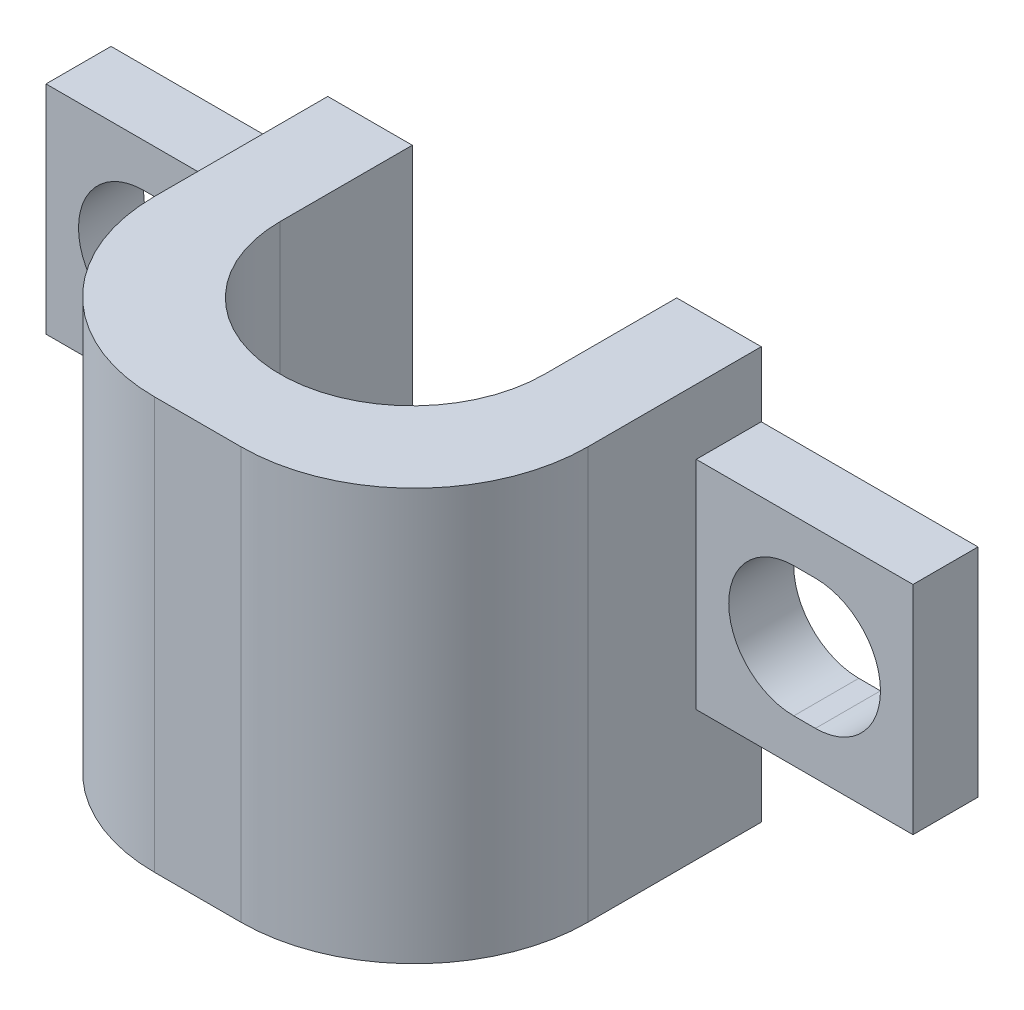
ISO-10303-21;
HEADER;
FILE_DESCRIPTION(('STEP AP214'),'2;1');
FILE_NAME('part.step','',(''),(''),'','','');
FILE_SCHEMA(('AUTOMOTIVE_DESIGN { 1 0 10303 214 1 1 1 1 }'));
ENDSEC;
DATA;
#1=APPLICATION_CONTEXT('core data for automotive mechanical design processes');
#2=APPLICATION_PROTOCOL_DEFINITION('international standard','automotive_design',2000,#1);
#3=PRODUCT_CONTEXT('',#1,'mechanical');
#4=PRODUCT('Part','Part','',(#3));
#5=PRODUCT_RELATED_PRODUCT_CATEGORY('part','',(#4));
#6=PRODUCT_DEFINITION_FORMATION('','',#4);
#7=PRODUCT_DEFINITION_CONTEXT('part definition',#1,'design');
#8=PRODUCT_DEFINITION('design','',#6,#7);
#9=PRODUCT_DEFINITION_SHAPE('','',#8);
#10=(LENGTH_UNIT() NAMED_UNIT(*) SI_UNIT(.MILLI.,.METRE.));
#11=(NAMED_UNIT(*) PLANE_ANGLE_UNIT() SI_UNIT($,.RADIAN.));
#12=(NAMED_UNIT(*) SI_UNIT($,.STERADIAN.) SOLID_ANGLE_UNIT());
#13=UNCERTAINTY_MEASURE_WITH_UNIT(LENGTH_MEASURE(1.E-05),#10,'distance_accuracy_value','');
#14=(GEOMETRIC_REPRESENTATION_CONTEXT(3) GLOBAL_UNCERTAINTY_ASSIGNED_CONTEXT((#13)) GLOBAL_UNIT_ASSIGNED_CONTEXT((#10,
#11,#12)) REPRESENTATION_CONTEXT('',''));
#15=CARTESIAN_POINT('',(0.,0.,0.));
#16=DIRECTION('',(0.,0.,1.));
#17=DIRECTION('',(1.,0.,0.));
#18=AXIS2_PLACEMENT_3D('',#15,#16,#17);
#19=CARTESIAN_POINT('',(-5.,8.,-3.05));
#20=DIRECTION('',(1.,0.,0.));
#21=DIRECTION('',(0.,0.,-1.));
#22=AXIS2_PLACEMENT_3D('',#19,#20,#21);
#23=PLANE('',#22);
#24=DIRECTION('',(0.,0.,-1.));
#25=VECTOR('',#24,1.);
#26=CARTESIAN_POINT('',(-5.,1.5,-1.55));
#27=LINE('',#26,#25);
#28=CARTESIAN_POINT('',(-5.,1.5,-1.55));
#29=VERTEX_POINT('',#28);
#30=CARTESIAN_POINT('',(-5.,1.5,-3.05));
#31=VERTEX_POINT('',#30);
#32=EDGE_CURVE('E388',#29,#31,#27,.T.);
#33=ORIENTED_EDGE('',*,*,#32,.T.);
#34=DIRECTION('',(0.,-1.,0.));
#35=VECTOR('',#34,1.);
#36=CARTESIAN_POINT('',(-5.,8.,-3.05));
#37=LINE('',#36,#35);
#38=CARTESIAN_POINT('',(-5.,-1.5,-3.05));
#39=VERTEX_POINT('',#38);
#40=EDGE_CURVE('E246',#31,#39,#37,.T.);
#41=ORIENTED_EDGE('',*,*,#40,.T.);
#42=DIRECTION('',(0.,0.,-1.));
#43=VECTOR('',#42,1.);
#44=CARTESIAN_POINT('',(-5.,-1.5,0.95));
#45=LINE('',#44,#43);
#46=CARTESIAN_POINT('',(-5.,-1.5,0.95));
#47=VERTEX_POINT('',#46);
#48=EDGE_CURVE('E245',#47,#39,#45,.T.);
#49=ORIENTED_EDGE('',*,*,#48,.F.);
#50=DIRECTION('',(0.,-1.,0.));
#51=VECTOR('',#50,1.);
#52=CARTESIAN_POINT('',(-5.,8.,0.95));
#53=LINE('',#52,#51);
#54=CARTESIAN_POINT('',(-5.,8.,0.95));
#55=VERTEX_POINT('',#54);
#56=EDGE_CURVE('E11',#55,#47,#53,.T.);
#57=ORIENTED_EDGE('',*,*,#56,.F.);
#58=DIRECTION('',(0.,0.,1.));
#59=VECTOR('',#58,1.);
#60=CARTESIAN_POINT('',(-5.,8.,-3.05));
#61=LINE('',#60,#59);
#62=CARTESIAN_POINT('',(-5.,8.,-3.05));
#63=VERTEX_POINT('',#62);
#64=EDGE_CURVE('E481',#63,#55,#61,.T.);
#65=ORIENTED_EDGE('',*,*,#64,.F.);
#66=CARTESIAN_POINT('',(-5.,6.5,-3.05));
#67=VERTEX_POINT('',#66);
#68=EDGE_CURVE('E521',#63,#67,#37,.T.);
#69=ORIENTED_EDGE('',*,*,#68,.T.);
#70=DIRECTION('',(0.,0.,-1.));
#71=VECTOR('',#70,1.);
#72=CARTESIAN_POINT('',(-5.,6.5,-1.55));
#73=LINE('',#72,#71);
#74=CARTESIAN_POINT('',(-5.,6.5,-1.55));
#75=VERTEX_POINT('',#74);
#76=EDGE_CURVE('E61',#75,#67,#73,.T.);
#77=ORIENTED_EDGE('',*,*,#76,.F.);
#78=DIRECTION('',(0.,1.,0.));
#79=VECTOR('',#78,1.);
#80=CARTESIAN_POINT('',(-5.,6.5,-1.55));
#81=LINE('',#80,#79);
#82=EDGE_CURVE('E56',#29,#75,#81,.T.);
#83=ORIENTED_EDGE('',*,*,#82,.F.);
#84=EDGE_LOOP('',(#33,#41,#49,#57,#65,#69,#77,#83));
#85=FACE_BOUND('',#84,.T.);
#86=ADVANCED_FACE('F41',(#85),#23,.F.);
#87=CARTESIAN_POINT('',(-1.,8.,0.950000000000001));
#88=DIRECTION('',(0.,-1.,0.));
#89=DIRECTION('',(0.,0.,-1.));
#90=AXIS2_PLACEMENT_3D('',#87,#88,#89);
#91=CYLINDRICAL_SURFACE('',#90,4.);
#92=ORIENTED_EDGE('',*,*,#56,.T.);
#93=CARTESIAN_POINT('',(-1.,-1.5,0.950000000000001));
#94=DIRECTION('',(0.,-1.,0.));
#95=DIRECTION('',(0.,0.,-1.));
#96=AXIS2_PLACEMENT_3D('',#93,#94,#95);
#97=CIRCLE('',#96,4.);
#98=CARTESIAN_POINT('',(-1.,-1.5,4.95));
#99=VERTEX_POINT('',#98);
#100=EDGE_CURVE('E240',#99,#47,#97,.T.);
#101=ORIENTED_EDGE('',*,*,#100,.F.);
#102=DIRECTION('',(0.,-1.,0.));
#103=VECTOR('',#102,1.);
#104=CARTESIAN_POINT('',(-1.,8.,4.95));
#105=LINE('',#104,#103);
#106=CARTESIAN_POINT('',(-1.,8.,4.95));
#107=VERTEX_POINT('',#106);
#108=EDGE_CURVE('E49',#107,#99,#105,.T.);
#109=ORIENTED_EDGE('',*,*,#108,.F.);
#110=CARTESIAN_POINT('',(-1.,8.,0.950000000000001));
#111=DIRECTION('',(0.,1.,0.));
#112=DIRECTION('',(0.,0.,1.));
#113=AXIS2_PLACEMENT_3D('',#110,#111,#112);
#114=CIRCLE('',#113,4.);
#115=EDGE_CURVE('E241',#55,#107,#114,.T.);
#116=ORIENTED_EDGE('',*,*,#115,.F.);
#117=EDGE_LOOP('',(#92,#101,#109,#116));
#118=FACE_BOUND('',#117,.T.);
#119=ADVANCED_FACE('F237',(#118),#91,.T.);
#120=CARTESIAN_POINT('',(-1.,8.,4.95));
#121=DIRECTION('',(0.,0.,-1.));
#122=DIRECTION('',(-1.,0.,0.));
#123=AXIS2_PLACEMENT_3D('',#120,#121,#122);
#124=PLANE('',#123);
#125=ORIENTED_EDGE('',*,*,#108,.T.);
#126=DIRECTION('',(-1.,0.,0.));
#127=VECTOR('',#126,1.);
#128=CARTESIAN_POINT('',(1.,-1.5,4.95));
#129=LINE('',#128,#127);
#130=CARTESIAN_POINT('',(1.,-1.5,4.95));
#131=VERTEX_POINT('',#130);
#132=EDGE_CURVE('E256',#131,#99,#129,.T.);
#133=ORIENTED_EDGE('',*,*,#132,.F.);
#134=DIRECTION('',(0.,-1.,0.));
#135=VECTOR('',#134,1.);
#136=CARTESIAN_POINT('',(1.,8.,4.95));
#137=LINE('',#136,#135);
#138=CARTESIAN_POINT('',(1.,8.,4.95));
#139=VERTEX_POINT('',#138);
#140=EDGE_CURVE('E548',#139,#131,#137,.T.);
#141=ORIENTED_EDGE('',*,*,#140,.F.);
#142=DIRECTION('',(1.,0.,0.));
#143=VECTOR('',#142,1.);
#144=CARTESIAN_POINT('',(-1.,8.,4.95));
#145=LINE('',#144,#143);
#146=EDGE_CURVE('E487',#107,#139,#145,.T.);
#147=ORIENTED_EDGE('',*,*,#146,.F.);
#148=EDGE_LOOP('',(#125,#133,#141,#147));
#149=FACE_BOUND('',#148,.T.);
#150=ADVANCED_FACE('F553',(#149),#124,.F.);
#151=CARTESIAN_POINT('',(1.,8.,0.950000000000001));
#152=DIRECTION('',(0.,-1.,0.));
#153=DIRECTION('',(0.,0.,-1.));
#154=AXIS2_PLACEMENT_3D('',#151,#152,#153);
#155=CYLINDRICAL_SURFACE('',#154,4.);
#156=ORIENTED_EDGE('',*,*,#140,.T.);
#157=CARTESIAN_POINT('',(1.,-1.5,0.950000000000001));
#158=DIRECTION('',(0.,-1.,0.));
#159=DIRECTION('',(0.,0.,-1.));
#160=AXIS2_PLACEMENT_3D('',#157,#158,#159);
#161=CIRCLE('',#160,4.);
#162=CARTESIAN_POINT('',(5.,-1.5,0.95));
#163=VERTEX_POINT('',#162);
#164=EDGE_CURVE('E284',#163,#131,#161,.T.);
#165=ORIENTED_EDGE('',*,*,#164,.F.);
#166=DIRECTION('',(0.,-1.,0.));
#167=VECTOR('',#166,1.);
#168=CARTESIAN_POINT('',(5.,8.,0.95));
#169=LINE('',#168,#167);
#170=CARTESIAN_POINT('',(5.,8.,0.95));
#171=VERTEX_POINT('',#170);
#172=EDGE_CURVE('E545',#171,#163,#169,.T.);
#173=ORIENTED_EDGE('',*,*,#172,.F.);
#174=CARTESIAN_POINT('',(1.,8.,0.950000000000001));
#175=DIRECTION('',(0.,1.,0.));
#176=DIRECTION('',(0.,0.,1.));
#177=AXIS2_PLACEMENT_3D('',#174,#175,#176);
#178=CIRCLE('',#177,4.);
#179=EDGE_CURVE('E490',#139,#171,#178,.T.);
#180=ORIENTED_EDGE('',*,*,#179,.F.);
#181=EDGE_LOOP('',(#156,#165,#173,#180));
#182=FACE_BOUND('',#181,.T.);
#183=ADVANCED_FACE('F597',(#182),#155,.T.);
#184=CARTESIAN_POINT('',(5.,8.,-3.05));
#185=DIRECTION('',(-1.,0.,0.));
#186=DIRECTION('',(0.,0.,1.));
#187=AXIS2_PLACEMENT_3D('',#184,#185,#186);
#188=PLANE('',#187);
#189=DIRECTION('',(0.,1.,0.));
#190=VECTOR('',#189,1.);
#191=CARTESIAN_POINT('',(5.,6.5,-1.55));
#192=LINE('',#191,#190);
#193=CARTESIAN_POINT('',(5.,1.5,-1.55));
#194=VERTEX_POINT('',#193);
#195=CARTESIAN_POINT('',(5.,6.5,-1.55));
#196=VERTEX_POINT('',#195);
#197=EDGE_CURVE('E449',#194,#196,#192,.T.);
#198=ORIENTED_EDGE('',*,*,#197,.T.);
#199=DIRECTION('',(0.,0.,-1.));
#200=VECTOR('',#199,1.);
#201=CARTESIAN_POINT('',(5.,6.5,-1.55));
#202=LINE('',#201,#200);
#203=CARTESIAN_POINT('',(5.,6.5,-3.05));
#204=VERTEX_POINT('',#203);
#205=EDGE_CURVE('E471',#196,#204,#202,.T.);
#206=ORIENTED_EDGE('',*,*,#205,.T.);
#207=DIRECTION('',(0.,-1.,0.));
#208=VECTOR('',#207,1.);
#209=CARTESIAN_POINT('',(5.,8.,-3.05));
#210=LINE('',#209,#208);
#211=CARTESIAN_POINT('',(5.,8.,-3.05));
#212=VERTEX_POINT('',#211);
#213=EDGE_CURVE('E541',#212,#204,#210,.T.);
#214=ORIENTED_EDGE('',*,*,#213,.F.);
#215=DIRECTION('',(0.,0.,-1.));
#216=VECTOR('',#215,1.);
#217=CARTESIAN_POINT('',(5.,8.,-3.05));
#218=LINE('',#217,#216);
#219=EDGE_CURVE('E493',#171,#212,#218,.T.);
#220=ORIENTED_EDGE('',*,*,#219,.F.);
#221=ORIENTED_EDGE('',*,*,#172,.T.);
#222=DIRECTION('',(0.,0.,1.));
#223=VECTOR('',#222,1.);
#224=CARTESIAN_POINT('',(5.,-1.5,-3.05));
#225=LINE('',#224,#223);
#226=CARTESIAN_POINT('',(5.,-1.5,-3.05));
#227=VERTEX_POINT('',#226);
#228=EDGE_CURVE('E280',#227,#163,#225,.T.);
#229=ORIENTED_EDGE('',*,*,#228,.F.);
#230=CARTESIAN_POINT('',(5.,1.5,-3.05));
#231=VERTEX_POINT('',#230);
#232=EDGE_CURVE('E540',#231,#227,#210,.T.);
#233=ORIENTED_EDGE('',*,*,#232,.F.);
#234=DIRECTION('',(0.,0.,-1.));
#235=VECTOR('',#234,1.);
#236=CARTESIAN_POINT('',(5.,1.5,-1.55));
#237=LINE('',#236,#235);
#238=EDGE_CURVE('E475',#194,#231,#237,.T.);
#239=ORIENTED_EDGE('',*,*,#238,.F.);
#240=EDGE_LOOP('',(#198,#206,#214,#220,#221,#229,#233,#239));
#241=FACE_BOUND('',#240,.T.);
#242=ADVANCED_FACE('F602',(#241),#188,.F.);
#243=CARTESIAN_POINT('',(3.05,8.,-3.05));
#244=DIRECTION('',(0.,0.,1.));
#245=DIRECTION('',(1.,0.,0.));
#246=AXIS2_PLACEMENT_3D('',#243,#244,#245);
#247=PLANE('',#246);
#248=ORIENTED_EDGE('',*,*,#232,.T.);
#249=DIRECTION('',(1.,0.,0.));
#250=VECTOR('',#249,1.);
#251=CARTESIAN_POINT('',(2.,-1.5,-3.05));
#252=LINE('',#251,#250);
#253=CARTESIAN_POINT('',(2.,-1.5,-3.05));
#254=VERTEX_POINT('',#253);
#255=EDGE_CURVE('E276',#254,#227,#252,.T.);
#256=ORIENTED_EDGE('',*,*,#255,.F.);
#257=DIRECTION('',(0.,1.,0.));
#258=VECTOR('',#257,1.);
#259=CARTESIAN_POINT('',(2.,-1.5,-3.05));
#260=LINE('',#259,#258);
#261=CARTESIAN_POINT('',(2.,0.,-3.05));
#262=VERTEX_POINT('',#261);
#263=EDGE_CURVE('E289',#254,#262,#260,.T.);
#264=ORIENTED_EDGE('',*,*,#263,.T.);
#265=DIRECTION('',(1.,0.,0.));
#266=VECTOR('',#265,1.);
#267=CARTESIAN_POINT('',(2.,0.,-3.05));
#268=LINE('',#267,#266);
#269=CARTESIAN_POINT('',(3.05,0.,-3.05));
#270=VERTEX_POINT('',#269);
#271=EDGE_CURVE('E258',#262,#270,#268,.T.);
#272=ORIENTED_EDGE('',*,*,#271,.T.);
#273=DIRECTION('',(0.,-1.,0.));
#274=VECTOR('',#273,1.);
#275=CARTESIAN_POINT('',(3.05,8.,-3.05));
#276=LINE('',#275,#274);
#277=CARTESIAN_POINT('',(3.05,8.,-3.05));
#278=VERTEX_POINT('',#277);
#279=EDGE_CURVE('E536',#278,#270,#276,.T.);
#280=ORIENTED_EDGE('',*,*,#279,.F.);
#281=DIRECTION('',(-1.,0.,0.));
#282=VECTOR('',#281,1.);
#283=CARTESIAN_POINT('',(3.05,8.,-3.05));
#284=LINE('',#283,#282);
#285=EDGE_CURVE('E496',#212,#278,#284,.T.);
#286=ORIENTED_EDGE('',*,*,#285,.F.);
#287=ORIENTED_EDGE('',*,*,#213,.T.);
#288=DIRECTION('',(1.,0.,0.));
#289=VECTOR('',#288,1.);
#290=CARTESIAN_POINT('',(10.,6.5,-3.05));
#291=LINE('',#290,#289);
#292=CARTESIAN_POINT('',(10.,6.5,-3.05));
#293=VERTEX_POINT('',#292);
#294=EDGE_CURVE('E445',#204,#293,#291,.T.);
#295=ORIENTED_EDGE('',*,*,#294,.T.);
#296=DIRECTION('',(0.,-1.,0.));
#297=VECTOR('',#296,1.);
#298=CARTESIAN_POINT('',(10.,6.5,-3.05));
#299=LINE('',#298,#297);
#300=CARTESIAN_POINT('',(10.,1.5,-3.05));
#301=VERTEX_POINT('',#300);
#302=EDGE_CURVE('E430',#293,#301,#299,.T.);
#303=ORIENTED_EDGE('',*,*,#302,.T.);
#304=DIRECTION('',(-1.,0.,0.));
#305=VECTOR('',#304,1.);
#306=CARTESIAN_POINT('',(10.,1.5,-3.05));
#307=LINE('',#306,#305);
#308=EDGE_CURVE('E461',#301,#231,#307,.T.);
#309=ORIENTED_EDGE('',*,*,#308,.T.);
#310=EDGE_LOOP('',(#248,#256,#264,#272,#280,#286,#287,#295,#303,#309));
#311=FACE_BOUND('',#310,.T.);
#312=CARTESIAN_POINT('',(7.75,4.,-3.05));
#313=DIRECTION('',(0.,0.,-1.));
#314=DIRECTION('',(-1.,0.,0.));
#315=AXIS2_PLACEMENT_3D('',#312,#313,#314);
#316=CIRCLE('',#315,1.5);
#317=CARTESIAN_POINT('',(7.75,5.5,-3.05));
#318=VERTEX_POINT('',#317);
#319=CARTESIAN_POINT('',(7.75,2.5,-3.05));
#320=VERTEX_POINT('',#319);
#321=EDGE_CURVE('E387',#318,#320,#316,.T.);
#322=ORIENTED_EDGE('',*,*,#321,.F.);
#323=DIRECTION('',(1.,0.,0.));
#324=VECTOR('',#323,1.);
#325=CARTESIAN_POINT('',(7.75,5.5,-3.05));
#326=LINE('',#325,#324);
#327=CARTESIAN_POINT('',(7.25,5.5,-3.05));
#328=VERTEX_POINT('',#327);
#329=EDGE_CURVE('E401',#328,#318,#326,.T.);
#330=ORIENTED_EDGE('',*,*,#329,.F.);
#331=CARTESIAN_POINT('',(7.25,4.,-3.05));
#332=DIRECTION('',(0.,0.,-1.));
#333=DIRECTION('',(-1.,0.,0.));
#334=AXIS2_PLACEMENT_3D('',#331,#332,#333);
#335=CIRCLE('',#334,1.5);
#336=CARTESIAN_POINT('',(7.25,2.5,-3.05));
#337=VERTEX_POINT('',#336);
#338=EDGE_CURVE('E420',#337,#328,#335,.T.);
#339=ORIENTED_EDGE('',*,*,#338,.F.);
#340=DIRECTION('',(-1.,0.,0.));
#341=VECTOR('',#340,1.);
#342=CARTESIAN_POINT('',(7.75,2.5,-3.05));
#343=LINE('',#342,#341);
#344=EDGE_CURVE('E416',#320,#337,#343,.T.);
#345=ORIENTED_EDGE('',*,*,#344,.F.);
#346=EDGE_LOOP('',(#322,#330,#339,#345));
#347=FACE_BOUND('',#346,.T.);
#348=ADVANCED_FACE('F606',(#311,#347),#247,.F.);
#349=CARTESIAN_POINT('',(3.05,8.,0.));
#350=DIRECTION('',(1.,0.,0.));
#351=DIRECTION('',(0.,0.,-1.));
#352=AXIS2_PLACEMENT_3D('',#349,#350,#351);
#353=PLANE('',#352);
#354=DIRECTION('',(0.,0.,1.));
#355=VECTOR('',#354,1.);
#356=CARTESIAN_POINT('',(3.05,0.,0.));
#357=LINE('',#356,#355);
#358=CARTESIAN_POINT('',(3.05,0.,0.));
#359=VERTEX_POINT('',#358);
#360=EDGE_CURVE('E470',#270,#359,#357,.T.);
#361=ORIENTED_EDGE('',*,*,#360,.T.);
#362=DIRECTION('',(0.,-1.,0.));
#363=VECTOR('',#362,1.);
#364=CARTESIAN_POINT('',(3.05,8.,0.));
#365=LINE('',#364,#363);
#366=CARTESIAN_POINT('',(3.05,8.,0.));
#367=VERTEX_POINT('',#366);
#368=EDGE_CURVE('E532',#367,#359,#365,.T.);
#369=ORIENTED_EDGE('',*,*,#368,.F.);
#370=DIRECTION('',(0.,0.,1.));
#371=VECTOR('',#370,1.);
#372=CARTESIAN_POINT('',(3.05,8.,0.));
#373=LINE('',#372,#371);
#374=EDGE_CURVE('E499',#278,#367,#373,.T.);
#375=ORIENTED_EDGE('',*,*,#374,.F.);
#376=ORIENTED_EDGE('',*,*,#279,.T.);
#377=EDGE_LOOP('',(#361,#369,#375,#376));
#378=FACE_BOUND('',#377,.T.);
#379=ADVANCED_FACE('F610',(#378),#353,.F.);
#380=CARTESIAN_POINT('',(0.,8.,0.));
#381=DIRECTION('',(0.,-1.,0.));
#382=DIRECTION('',(0.,0.,-1.));
#383=AXIS2_PLACEMENT_3D('',#380,#381,#382);
#384=CYLINDRICAL_SURFACE('',#383,3.05);
#385=CARTESIAN_POINT('',(0.,0.,0.));
#386=DIRECTION('',(0.,-1.,0.));
#387=DIRECTION('',(0.,0.,1.));
#388=AXIS2_PLACEMENT_3D('',#385,#386,#387);
#389=CIRCLE('',#388,3.05);
#390=CARTESIAN_POINT('',(-3.05,0.,0.));
#391=VERTEX_POINT('',#390);
#392=EDGE_CURVE('E514',#359,#391,#389,.T.);
#393=ORIENTED_EDGE('',*,*,#392,.T.);
#394=DIRECTION('',(0.,-1.,0.));
#395=VECTOR('',#394,1.);
#396=CARTESIAN_POINT('',(-3.05,8.,0.));
#397=LINE('',#396,#395);
#398=CARTESIAN_POINT('',(-3.05,8.,0.));
#399=VERTEX_POINT('',#398);
#400=EDGE_CURVE('E528',#399,#391,#397,.T.);
#401=ORIENTED_EDGE('',*,*,#400,.F.);
#402=CARTESIAN_POINT('',(0.,8.,0.));
#403=DIRECTION('',(0.,-1.,0.));
#404=DIRECTION('',(0.,0.,1.));
#405=AXIS2_PLACEMENT_3D('',#402,#403,#404);
#406=CIRCLE('',#405,3.05);
#407=EDGE_CURVE('E502',#367,#399,#406,.T.);
#408=ORIENTED_EDGE('',*,*,#407,.F.);
#409=ORIENTED_EDGE('',*,*,#368,.T.);
#410=EDGE_LOOP('',(#393,#401,#408,#409));
#411=FACE_BOUND('',#410,.T.);
#412=ADVANCED_FACE('F614',(#411),#384,.F.);
#413=CARTESIAN_POINT('',(-3.05,8.,0.));
#414=DIRECTION('',(-1.,0.,0.));
#415=DIRECTION('',(0.,0.,1.));
#416=AXIS2_PLACEMENT_3D('',#413,#414,#415);
#417=PLANE('',#416);
#418=DIRECTION('',(0.,0.,-1.));
#419=VECTOR('',#418,1.);
#420=CARTESIAN_POINT('',(-3.05,0.,0.));
#421=LINE('',#420,#419);
#422=CARTESIAN_POINT('',(-3.05,0.,-3.05));
#423=VERTEX_POINT('',#422);
#424=EDGE_CURVE('E484',#391,#423,#421,.T.);
#425=ORIENTED_EDGE('',*,*,#424,.T.);
#426=DIRECTION('',(0.,-1.,0.));
#427=VECTOR('',#426,1.);
#428=CARTESIAN_POINT('',(-3.05,8.,-3.05));
#429=LINE('',#428,#427);
#430=CARTESIAN_POINT('',(-3.05,8.,-3.05));
#431=VERTEX_POINT('',#430);
#432=EDGE_CURVE('E524',#431,#423,#429,.T.);
#433=ORIENTED_EDGE('',*,*,#432,.F.);
#434=DIRECTION('',(0.,0.,-1.));
#435=VECTOR('',#434,1.);
#436=CARTESIAN_POINT('',(-3.05,8.,0.));
#437=LINE('',#436,#435);
#438=EDGE_CURVE('E505',#399,#431,#437,.T.);
#439=ORIENTED_EDGE('',*,*,#438,.F.);
#440=ORIENTED_EDGE('',*,*,#400,.T.);
#441=EDGE_LOOP('',(#425,#433,#439,#440));
#442=FACE_BOUND('',#441,.T.);
#443=ADVANCED_FACE('F618',(#442),#417,.F.);
#444=CARTESIAN_POINT('',(-5.,8.,-3.05));
#445=DIRECTION('',(0.,0.,1.));
#446=DIRECTION('',(1.,0.,0.));
#447=AXIS2_PLACEMENT_3D('',#444,#445,#446);
#448=PLANE('',#447);
#449=ORIENTED_EDGE('',*,*,#432,.T.);
#450=DIRECTION('',(1.,0.,0.));
#451=VECTOR('',#450,1.);
#452=CARTESIAN_POINT('',(-2.,0.,-3.05));
#453=LINE('',#452,#451);
#454=CARTESIAN_POINT('',(-2.,0.,-3.05));
#455=VERTEX_POINT('',#454);
#456=EDGE_CURVE('E290',#423,#455,#453,.T.);
#457=ORIENTED_EDGE('',*,*,#456,.T.);
#458=DIRECTION('',(0.,1.,0.));
#459=VECTOR('',#458,1.);
#460=CARTESIAN_POINT('',(-2.,-1.5,-3.05));
#461=LINE('',#460,#459);
#462=CARTESIAN_POINT('',(-2.,-1.5,-3.05));
#463=VERTEX_POINT('',#462);
#464=EDGE_CURVE('E312',#463,#455,#461,.T.);
#465=ORIENTED_EDGE('',*,*,#464,.F.);
#466=DIRECTION('',(1.,0.,0.));
#467=VECTOR('',#466,1.);
#468=CARTESIAN_POINT('',(-2.,-1.5,-3.05));
#469=LINE('',#468,#467);
#470=EDGE_CURVE('E250',#39,#463,#469,.T.);
#471=ORIENTED_EDGE('',*,*,#470,.F.);
#472=ORIENTED_EDGE('',*,*,#40,.F.);
#473=DIRECTION('',(1.,0.,0.));
#474=VECTOR('',#473,1.);
#475=CARTESIAN_POINT('',(-10.,1.5,-3.05));
#476=LINE('',#475,#474);
#477=CARTESIAN_POINT('',(-10.,1.5,-3.05));
#478=VERTEX_POINT('',#477);
#479=EDGE_CURVE('E365',#478,#31,#476,.T.);
#480=ORIENTED_EDGE('',*,*,#479,.F.);
#481=DIRECTION('',(0.,-1.,0.));
#482=VECTOR('',#481,1.);
#483=CARTESIAN_POINT('',(-10.,6.5,-3.05));
#484=LINE('',#483,#482);
#485=CARTESIAN_POINT('',(-10.,6.5,-3.05));
#486=VERTEX_POINT('',#485);
#487=EDGE_CURVE('E350',#486,#478,#484,.T.);
#488=ORIENTED_EDGE('',*,*,#487,.F.);
#489=DIRECTION('',(-1.,0.,0.));
#490=VECTOR('',#489,1.);
#491=CARTESIAN_POINT('',(-10.,6.5,-3.05));
#492=LINE('',#491,#490);
#493=EDGE_CURVE('E377',#67,#486,#492,.T.);
#494=ORIENTED_EDGE('',*,*,#493,.F.);
#495=ORIENTED_EDGE('',*,*,#68,.F.);
#496=DIRECTION('',(-1.,0.,0.));
#497=VECTOR('',#496,1.);
#498=CARTESIAN_POINT('',(-5.,8.,-3.05));
#499=LINE('',#498,#497);
#500=EDGE_CURVE('E508',#431,#63,#499,.T.);
#501=ORIENTED_EDGE('',*,*,#500,.F.);
#502=EDGE_LOOP('',(#449,#457,#465,#471,#472,#480,#488,#494,#495,#501));
#503=FACE_BOUND('',#502,.T.);
#504=DIRECTION('',(-1.,0.,0.));
#505=VECTOR('',#504,1.);
#506=CARTESIAN_POINT('',(-7.75,5.5,-3.05));
#507=LINE('',#506,#505);
#508=CARTESIAN_POINT('',(-7.25,5.5,-3.05));
#509=VERTEX_POINT('',#508);
#510=CARTESIAN_POINT('',(-7.75,5.5,-3.05));
#511=VERTEX_POINT('',#510);
#512=EDGE_CURVE('E335',#509,#511,#507,.T.);
#513=ORIENTED_EDGE('',*,*,#512,.T.);
#514=CARTESIAN_POINT('',(-7.75,4.,-3.05));
#515=DIRECTION('',(0.,0.,1.));
#516=DIRECTION('',(1.,0.,0.));
#517=AXIS2_PLACEMENT_3D('',#514,#515,#516);
#518=CIRCLE('',#517,1.5);
#519=CARTESIAN_POINT('',(-7.75,2.5,-3.05));
#520=VERTEX_POINT('',#519);
#521=EDGE_CURVE('E316',#511,#520,#518,.T.);
#522=ORIENTED_EDGE('',*,*,#521,.T.);
#523=DIRECTION('',(1.,0.,0.));
#524=VECTOR('',#523,1.);
#525=CARTESIAN_POINT('',(-7.75,2.5,-3.05));
#526=LINE('',#525,#524);
#527=CARTESIAN_POINT('',(-7.25,2.5,-3.05));
#528=VERTEX_POINT('',#527);
#529=EDGE_CURVE('E321',#520,#528,#526,.T.);
#530=ORIENTED_EDGE('',*,*,#529,.T.);
#531=CARTESIAN_POINT('',(-7.25,4.,-3.05));
#532=DIRECTION('',(0.,0.,1.));
#533=DIRECTION('',(1.,0.,0.));
#534=AXIS2_PLACEMENT_3D('',#531,#532,#533);
#535=CIRCLE('',#534,1.5);
#536=EDGE_CURVE('E339',#528,#509,#535,.T.);
#537=ORIENTED_EDGE('',*,*,#536,.T.);
#538=EDGE_LOOP('',(#513,#522,#530,#537));
#539=FACE_BOUND('',#538,.T.);
#540=ADVANCED_FACE('F568',(#503,#539),#448,.F.);
#541=CARTESIAN_POINT('',(-1.,8.,0.950000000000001));
#542=DIRECTION('',(0.,1.,0.));
#543=DIRECTION('',(0.,0.,1.));
#544=AXIS2_PLACEMENT_3D('',#541,#542,#543);
#545=PLANE('',#544);
#546=ORIENTED_EDGE('',*,*,#64,.T.);
#547=ORIENTED_EDGE('',*,*,#115,.T.);
#548=ORIENTED_EDGE('',*,*,#146,.T.);
#549=ORIENTED_EDGE('',*,*,#179,.T.);
#550=ORIENTED_EDGE('',*,*,#219,.T.);
#551=ORIENTED_EDGE('',*,*,#285,.T.);
#552=ORIENTED_EDGE('',*,*,#374,.T.);
#553=ORIENTED_EDGE('',*,*,#407,.T.);
#554=ORIENTED_EDGE('',*,*,#438,.T.);
#555=ORIENTED_EDGE('',*,*,#500,.T.);
#556=EDGE_LOOP('',(#546,#547,#548,#549,#550,#551,#552,#553,#554,#555));
#557=FACE_BOUND('',#556,.T.);
#558=ADVANCED_FACE('F557',(#557),#545,.T.);
#559=CARTESIAN_POINT('',(10.,6.5,-1.55));
#560=DIRECTION('',(1.,0.,0.));
#561=DIRECTION('',(0.,0.,-1.));
#562=AXIS2_PLACEMENT_3D('',#559,#560,#561);
#563=PLANE('',#562);
#564=ORIENTED_EDGE('',*,*,#302,.F.);
#565=DIRECTION('',(0.,0.,-1.));
#566=VECTOR('',#565,1.);
#567=CARTESIAN_POINT('',(10.,6.5,-1.55));
#568=LINE('',#567,#566);
#569=CARTESIAN_POINT('',(10.,6.5,-1.55));
#570=VERTEX_POINT('',#569);
#571=EDGE_CURVE('E467',#570,#293,#568,.T.);
#572=ORIENTED_EDGE('',*,*,#571,.F.);
#573=DIRECTION('',(0.,-1.,0.));
#574=VECTOR('',#573,1.);
#575=CARTESIAN_POINT('',(10.,6.5,-1.55));
#576=LINE('',#575,#574);
#577=CARTESIAN_POINT('',(10.,1.5,-1.55));
#578=VERTEX_POINT('',#577);
#579=EDGE_CURVE('E440',#570,#578,#576,.T.);
#580=ORIENTED_EDGE('',*,*,#579,.T.);
#581=DIRECTION('',(0.,0.,-1.));
#582=VECTOR('',#581,1.);
#583=CARTESIAN_POINT('',(10.,1.5,-1.55));
#584=LINE('',#583,#582);
#585=EDGE_CURVE('E457',#578,#301,#584,.T.);
#586=ORIENTED_EDGE('',*,*,#585,.T.);
#587=EDGE_LOOP('',(#564,#572,#580,#586));
#588=FACE_BOUND('',#587,.T.);
#589=ADVANCED_FACE('F627',(#588),#563,.T.);
#590=CARTESIAN_POINT('',(10.,6.5,-1.55));
#591=DIRECTION('',(0.,1.,0.));
#592=DIRECTION('',(0.,0.,1.));
#593=AXIS2_PLACEMENT_3D('',#590,#591,#592);
#594=PLANE('',#593);
#595=ORIENTED_EDGE('',*,*,#294,.F.);
#596=ORIENTED_EDGE('',*,*,#205,.F.);
#597=DIRECTION('',(1.,0.,0.));
#598=VECTOR('',#597,1.);
#599=CARTESIAN_POINT('',(10.,6.5,-1.55));
#600=LINE('',#599,#598);
#601=EDGE_CURVE('E453',#196,#570,#600,.T.);
#602=ORIENTED_EDGE('',*,*,#601,.T.);
#603=ORIENTED_EDGE('',*,*,#571,.T.);
#604=EDGE_LOOP('',(#595,#596,#602,#603));
#605=FACE_BOUND('',#604,.T.);
#606=ADVANCED_FACE('F630',(#605),#594,.T.);
#607=CARTESIAN_POINT('',(10.,1.5,-1.55));
#608=DIRECTION('',(0.,-1.,0.));
#609=DIRECTION('',(0.,0.,-1.));
#610=AXIS2_PLACEMENT_3D('',#607,#608,#609);
#611=PLANE('',#610);
#612=ORIENTED_EDGE('',*,*,#308,.F.);
#613=ORIENTED_EDGE('',*,*,#585,.F.);
#614=DIRECTION('',(-1.,0.,0.));
#615=VECTOR('',#614,1.);
#616=CARTESIAN_POINT('',(10.,1.5,-1.55));
#617=LINE('',#616,#615);
#618=EDGE_CURVE('E444',#578,#194,#617,.T.);
#619=ORIENTED_EDGE('',*,*,#618,.T.);
#620=ORIENTED_EDGE('',*,*,#238,.T.);
#621=EDGE_LOOP('',(#612,#613,#619,#620));
#622=FACE_BOUND('',#621,.T.);
#623=ADVANCED_FACE('F632',(#622),#611,.T.);
#624=CARTESIAN_POINT('',(0.,0.,-1.55));
#625=DIRECTION('',(0.,0.,-1.));
#626=DIRECTION('',(-1.,0.,0.));
#627=AXIS2_PLACEMENT_3D('',#624,#625,#626);
#628=PLANE('',#627);
#629=DIRECTION('',(1.,0.,0.));
#630=VECTOR('',#629,1.);
#631=CARTESIAN_POINT('',(7.75,5.5,-1.55));
#632=LINE('',#631,#630);
#633=CARTESIAN_POINT('',(7.25,5.5,-1.55));
#634=VERTEX_POINT('',#633);
#635=CARTESIAN_POINT('',(7.75,5.5,-1.55));
#636=VERTEX_POINT('',#635);
#637=EDGE_CURVE('E409',#634,#636,#632,.T.);
#638=ORIENTED_EDGE('',*,*,#637,.T.);
#639=CARTESIAN_POINT('',(7.75,4.,-1.55));
#640=DIRECTION('',(0.,0.,-1.));
#641=DIRECTION('',(-1.,0.,0.));
#642=AXIS2_PLACEMENT_3D('',#639,#640,#641);
#643=CIRCLE('',#642,1.5);
#644=CARTESIAN_POINT('',(7.75,2.5,-1.55));
#645=VERTEX_POINT('',#644);
#646=EDGE_CURVE('E396',#636,#645,#643,.T.);
#647=ORIENTED_EDGE('',*,*,#646,.T.);
#648=DIRECTION('',(-1.,0.,0.));
#649=VECTOR('',#648,1.);
#650=CARTESIAN_POINT('',(7.75,2.5,-1.55));
#651=LINE('',#650,#649);
#652=CARTESIAN_POINT('',(7.25,2.5,-1.55));
#653=VERTEX_POINT('',#652);
#654=EDGE_CURVE('E400',#645,#653,#651,.T.);
#655=ORIENTED_EDGE('',*,*,#654,.T.);
#656=CARTESIAN_POINT('',(7.25,4.,-1.55));
#657=DIRECTION('',(0.,0.,-1.));
#658=DIRECTION('',(-1.,0.,0.));
#659=AXIS2_PLACEMENT_3D('',#656,#657,#658);
#660=CIRCLE('',#659,1.5);
#661=EDGE_CURVE('E405',#653,#634,#660,.T.);
#662=ORIENTED_EDGE('',*,*,#661,.T.);
#663=EDGE_LOOP('',(#638,#647,#655,#662));
#664=FACE_BOUND('',#663,.T.);
#665=ORIENTED_EDGE('',*,*,#579,.F.);
#666=ORIENTED_EDGE('',*,*,#601,.F.);
#667=ORIENTED_EDGE('',*,*,#197,.F.);
#668=ORIENTED_EDGE('',*,*,#618,.F.);
#669=EDGE_LOOP('',(#665,#666,#667,#668));
#670=FACE_BOUND('',#669,.T.);
#671=ADVANCED_FACE('F635',(#664,#670),#628,.F.);
#672=CARTESIAN_POINT('',(7.75,4.,-1.55));
#673=DIRECTION('',(0.,0.,-1.));
#674=DIRECTION('',(-1.,0.,0.));
#675=AXIS2_PLACEMENT_3D('',#672,#673,#674);
#676=CYLINDRICAL_SURFACE('',#675,1.5);
#677=ORIENTED_EDGE('',*,*,#321,.T.);
#678=DIRECTION('',(0.,0.,-1.));
#679=VECTOR('',#678,1.);
#680=CARTESIAN_POINT('',(7.75,2.5,-1.55));
#681=LINE('',#680,#679);
#682=EDGE_CURVE('E413',#645,#320,#681,.T.);
#683=ORIENTED_EDGE('',*,*,#682,.F.);
#684=ORIENTED_EDGE('',*,*,#646,.F.);
#685=DIRECTION('',(0.,0.,-1.));
#686=VECTOR('',#685,1.);
#687=CARTESIAN_POINT('',(7.75,5.5,-1.55));
#688=LINE('',#687,#686);
#689=EDGE_CURVE('E427',#636,#318,#688,.T.);
#690=ORIENTED_EDGE('',*,*,#689,.T.);
#691=EDGE_LOOP('',(#677,#683,#684,#690));
#692=FACE_BOUND('',#691,.T.);
#693=ADVANCED_FACE('F642',(#692),#676,.F.);
#694=CARTESIAN_POINT('',(7.75,5.5,-1.55));
#695=DIRECTION('',(0.,1.,0.));
#696=DIRECTION('',(0.,0.,1.));
#697=AXIS2_PLACEMENT_3D('',#694,#695,#696);
#698=PLANE('',#697);
#699=ORIENTED_EDGE('',*,*,#329,.T.);
#700=ORIENTED_EDGE('',*,*,#689,.F.);
#701=ORIENTED_EDGE('',*,*,#637,.F.);
#702=DIRECTION('',(0.,0.,-1.));
#703=VECTOR('',#702,1.);
#704=CARTESIAN_POINT('',(7.25,5.5,-1.55));
#705=LINE('',#704,#703);
#706=EDGE_CURVE('E431',#634,#328,#705,.T.);
#707=ORIENTED_EDGE('',*,*,#706,.T.);
#708=EDGE_LOOP('',(#699,#700,#701,#707));
#709=FACE_BOUND('',#708,.T.);
#710=ADVANCED_FACE('F646',(#709),#698,.F.);
#711=CARTESIAN_POINT('',(7.25,4.,-1.55));
#712=DIRECTION('',(0.,0.,-1.));
#713=DIRECTION('',(-1.,0.,0.));
#714=AXIS2_PLACEMENT_3D('',#711,#712,#713);
#715=CYLINDRICAL_SURFACE('',#714,1.5);
#716=ORIENTED_EDGE('',*,*,#338,.T.);
#717=ORIENTED_EDGE('',*,*,#706,.F.);
#718=ORIENTED_EDGE('',*,*,#661,.F.);
#719=DIRECTION('',(0.,0.,-1.));
#720=VECTOR('',#719,1.);
#721=CARTESIAN_POINT('',(7.25,2.5,-1.55));
#722=LINE('',#721,#720);
#723=EDGE_CURVE('E434',#653,#337,#722,.T.);
#724=ORIENTED_EDGE('',*,*,#723,.T.);
#725=EDGE_LOOP('',(#716,#717,#718,#724));
#726=FACE_BOUND('',#725,.T.);
#727=ADVANCED_FACE('F651',(#726),#715,.F.);
#728=CARTESIAN_POINT('',(7.75,2.5,-1.55));
#729=DIRECTION('',(0.,-1.,0.));
#730=DIRECTION('',(1.,0.,0.));
#731=AXIS2_PLACEMENT_3D('',#728,#729,#730);
#732=PLANE('',#731);
#733=ORIENTED_EDGE('',*,*,#344,.T.);
#734=ORIENTED_EDGE('',*,*,#723,.F.);
#735=ORIENTED_EDGE('',*,*,#654,.F.);
#736=ORIENTED_EDGE('',*,*,#682,.T.);
#737=EDGE_LOOP('',(#733,#734,#735,#736));
#738=FACE_BOUND('',#737,.T.);
#739=ADVANCED_FACE('F648',(#738),#732,.F.);
#740=CARTESIAN_POINT('',(0.,0.,-1.55));
#741=DIRECTION('',(0.,0.,-1.));
#742=DIRECTION('',(1.,0.,0.));
#743=AXIS2_PLACEMENT_3D('',#740,#741,#742);
#744=PLANE('',#743);
#745=DIRECTION('',(0.,-1.,0.));
#746=VECTOR('',#745,1.);
#747=CARTESIAN_POINT('',(-10.,6.5,-1.55));
#748=LINE('',#747,#746);
#749=CARTESIAN_POINT('',(-10.,6.5,-1.55));
#750=VERTEX_POINT('',#749);
#751=CARTESIAN_POINT('',(-10.,1.5,-1.55));
#752=VERTEX_POINT('',#751);
#753=EDGE_CURVE('E360',#750,#752,#748,.T.);
#754=ORIENTED_EDGE('',*,*,#753,.T.);
#755=DIRECTION('',(1.,0.,0.));
#756=VECTOR('',#755,1.);
#757=CARTESIAN_POINT('',(-10.,1.5,-1.55));
#758=LINE('',#757,#756);
#759=EDGE_CURVE('E370',#752,#29,#758,.T.);
#760=ORIENTED_EDGE('',*,*,#759,.T.);
#761=ORIENTED_EDGE('',*,*,#82,.T.);
#762=DIRECTION('',(-1.,0.,0.));
#763=VECTOR('',#762,1.);
#764=CARTESIAN_POINT('',(-10.,6.5,-1.55));
#765=LINE('',#764,#763);
#766=EDGE_CURVE('E364',#75,#750,#765,.T.);
#767=ORIENTED_EDGE('',*,*,#766,.T.);
#768=EDGE_LOOP('',(#754,#760,#761,#767));
#769=FACE_BOUND('',#768,.T.);
#770=CARTESIAN_POINT('',(-7.75,4.,-1.55));
#771=DIRECTION('',(0.,0.,1.));
#772=DIRECTION('',(1.,0.,0.));
#773=AXIS2_PLACEMENT_3D('',#770,#771,#772);
#774=CIRCLE('',#773,1.5);
#775=CARTESIAN_POINT('',(-7.75,5.5,-1.55));
#776=VERTEX_POINT('',#775);
#777=CARTESIAN_POINT('',(-7.75,2.5,-1.55));
#778=VERTEX_POINT('',#777);
#779=EDGE_CURVE('E317',#776,#778,#774,.T.);
#780=ORIENTED_EDGE('',*,*,#779,.F.);
#781=DIRECTION('',(-1.,0.,0.));
#782=VECTOR('',#781,1.);
#783=CARTESIAN_POINT('',(-7.75,5.5,-1.55));
#784=LINE('',#783,#782);
#785=CARTESIAN_POINT('',(-7.25,5.5,-1.55));
#786=VERTEX_POINT('',#785);
#787=EDGE_CURVE('E320',#786,#776,#784,.T.);
#788=ORIENTED_EDGE('',*,*,#787,.F.);
#789=CARTESIAN_POINT('',(-7.25,4.,-1.55));
#790=DIRECTION('',(0.,0.,1.));
#791=DIRECTION('',(1.,0.,0.));
#792=AXIS2_PLACEMENT_3D('',#789,#790,#791);
#793=CIRCLE('',#792,1.5);
#794=CARTESIAN_POINT('',(-7.25,2.5,-1.55));
#795=VERTEX_POINT('',#794);
#796=EDGE_CURVE('E324',#795,#786,#793,.T.);
#797=ORIENTED_EDGE('',*,*,#796,.F.);
#798=DIRECTION('',(1.,0.,0.));
#799=VECTOR('',#798,1.);
#800=CARTESIAN_POINT('',(-7.75,2.5,-1.55));
#801=LINE('',#800,#799);
#802=EDGE_CURVE('E328',#778,#795,#801,.T.);
#803=ORIENTED_EDGE('',*,*,#802,.F.);
#804=EDGE_LOOP('',(#780,#788,#797,#803));
#805=FACE_BOUND('',#804,.T.);
#806=ADVANCED_FACE('F575',(#769,#805),#744,.F.);
#807=CARTESIAN_POINT('',(-10.,6.5,-1.55));
#808=DIRECTION('',(1.,0.,0.));
#809=DIRECTION('',(0.,0.,-1.));
#810=AXIS2_PLACEMENT_3D('',#807,#808,#809);
#811=PLANE('',#810);
#812=ORIENTED_EDGE('',*,*,#487,.T.);
#813=DIRECTION('',(0.,0.,-1.));
#814=VECTOR('',#813,1.);
#815=CARTESIAN_POINT('',(-10.,1.5,-1.55));
#816=LINE('',#815,#814);
#817=EDGE_CURVE('E383',#752,#478,#816,.T.);
#818=ORIENTED_EDGE('',*,*,#817,.F.);
#819=ORIENTED_EDGE('',*,*,#753,.F.);
#820=DIRECTION('',(0.,0.,-1.));
#821=VECTOR('',#820,1.);
#822=CARTESIAN_POINT('',(-10.,6.5,-1.55));
#823=LINE('',#822,#821);
#824=EDGE_CURVE('E373',#750,#486,#823,.T.);
#825=ORIENTED_EDGE('',*,*,#824,.T.);
#826=EDGE_LOOP('',(#812,#818,#819,#825));
#827=FACE_BOUND('',#826,.T.);
#828=ADVANCED_FACE('F572',(#827),#811,.F.);
#829=CARTESIAN_POINT('',(-10.,1.5,-1.55));
#830=DIRECTION('',(0.,1.,0.));
#831=DIRECTION('',(0.,0.,1.));
#832=AXIS2_PLACEMENT_3D('',#829,#830,#831);
#833=PLANE('',#832);
#834=ORIENTED_EDGE('',*,*,#479,.T.);
#835=ORIENTED_EDGE('',*,*,#32,.F.);
#836=ORIENTED_EDGE('',*,*,#759,.F.);
#837=ORIENTED_EDGE('',*,*,#817,.T.);
#838=EDGE_LOOP('',(#834,#835,#836,#837));
#839=FACE_BOUND('',#838,.T.);
#840=ADVANCED_FACE('F579',(#839),#833,.F.);
#841=CARTESIAN_POINT('',(-10.,6.5,-1.55));
#842=DIRECTION('',(0.,-1.,0.));
#843=DIRECTION('',(0.,0.,-1.));
#844=AXIS2_PLACEMENT_3D('',#841,#842,#843);
#845=PLANE('',#844);
#846=ORIENTED_EDGE('',*,*,#493,.T.);
#847=ORIENTED_EDGE('',*,*,#824,.F.);
#848=ORIENTED_EDGE('',*,*,#766,.F.);
#849=ORIENTED_EDGE('',*,*,#76,.T.);
#850=EDGE_LOOP('',(#846,#847,#848,#849));
#851=FACE_BOUND('',#850,.T.);
#852=ADVANCED_FACE('F565',(#851),#845,.F.);
#853=CARTESIAN_POINT('',(-7.75,4.,-1.55));
#854=DIRECTION('',(0.,0.,-1.));
#855=DIRECTION('',(-1.,0.,0.));
#856=AXIS2_PLACEMENT_3D('',#853,#854,#855);
#857=CYLINDRICAL_SURFACE('',#856,1.5);
#858=ORIENTED_EDGE('',*,*,#521,.F.);
#859=DIRECTION('',(0.,0.,-1.));
#860=VECTOR('',#859,1.);
#861=CARTESIAN_POINT('',(-7.75,5.5,-1.55));
#862=LINE('',#861,#860);
#863=EDGE_CURVE('E331',#776,#511,#862,.T.);
#864=ORIENTED_EDGE('',*,*,#863,.F.);
#865=ORIENTED_EDGE('',*,*,#779,.T.);
#866=DIRECTION('',(0.,0.,-1.));
#867=VECTOR('',#866,1.);
#868=CARTESIAN_POINT('',(-7.75,2.5,-1.55));
#869=LINE('',#868,#867);
#870=EDGE_CURVE('E346',#778,#520,#869,.T.);
#871=ORIENTED_EDGE('',*,*,#870,.T.);
#872=EDGE_LOOP('',(#858,#864,#865,#871));
#873=FACE_BOUND('',#872,.T.);
#874=ADVANCED_FACE('F586',(#873),#857,.F.);
#875=CARTESIAN_POINT('',(-7.75,2.5,-1.55));
#876=DIRECTION('',(0.,1.,0.));
#877=DIRECTION('',(-1.,0.,0.));
#878=AXIS2_PLACEMENT_3D('',#875,#876,#877);
#879=PLANE('',#878);
#880=ORIENTED_EDGE('',*,*,#529,.F.);
#881=ORIENTED_EDGE('',*,*,#870,.F.);
#882=ORIENTED_EDGE('',*,*,#802,.T.);
#883=DIRECTION('',(0.,0.,-1.));
#884=VECTOR('',#883,1.);
#885=CARTESIAN_POINT('',(-7.25,2.5,-1.55));
#886=LINE('',#885,#884);
#887=EDGE_CURVE('E351',#795,#528,#886,.T.);
#888=ORIENTED_EDGE('',*,*,#887,.T.);
#889=EDGE_LOOP('',(#880,#881,#882,#888));
#890=FACE_BOUND('',#889,.T.);
#891=ADVANCED_FACE('F724',(#890),#879,.T.);
#892=CARTESIAN_POINT('',(-7.25,4.,-1.55));
#893=DIRECTION('',(0.,0.,-1.));
#894=DIRECTION('',(-1.,0.,0.));
#895=AXIS2_PLACEMENT_3D('',#892,#893,#894);
#896=CYLINDRICAL_SURFACE('',#895,1.5);
#897=ORIENTED_EDGE('',*,*,#536,.F.);
#898=ORIENTED_EDGE('',*,*,#887,.F.);
#899=ORIENTED_EDGE('',*,*,#796,.T.);
#900=DIRECTION('',(0.,0.,-1.));
#901=VECTOR('',#900,1.);
#902=CARTESIAN_POINT('',(-7.25,5.5,-1.55));
#903=LINE('',#902,#901);
#904=EDGE_CURVE('E354',#786,#509,#903,.T.);
#905=ORIENTED_EDGE('',*,*,#904,.T.);
#906=EDGE_LOOP('',(#897,#898,#899,#905));
#907=FACE_BOUND('',#906,.T.);
#908=ADVANCED_FACE('F727',(#907),#896,.F.);
#909=CARTESIAN_POINT('',(-7.75,5.5,-1.55));
#910=DIRECTION('',(0.,-1.,0.));
#911=DIRECTION('',(0.,0.,-1.));
#912=AXIS2_PLACEMENT_3D('',#909,#910,#911);
#913=PLANE('',#912);
#914=ORIENTED_EDGE('',*,*,#512,.F.);
#915=ORIENTED_EDGE('',*,*,#904,.F.);
#916=ORIENTED_EDGE('',*,*,#787,.T.);
#917=ORIENTED_EDGE('',*,*,#863,.T.);
#918=EDGE_LOOP('',(#914,#915,#916,#917));
#919=FACE_BOUND('',#918,.T.);
#920=ADVANCED_FACE('F723',(#919),#913,.T.);
#921=CARTESIAN_POINT('',(-2.,-1.5,0.));
#922=DIRECTION('',(-1.,0.,0.));
#923=DIRECTION('',(0.,0.,1.));
#924=AXIS2_PLACEMENT_3D('',#921,#922,#923);
#925=PLANE('',#924);
#926=DIRECTION('',(0.,0.,1.));
#927=VECTOR('',#926,1.);
#928=CARTESIAN_POINT('',(-2.,0.,0.));
#929=LINE('',#928,#927);
#930=CARTESIAN_POINT('',(-2.,0.,0.));
#931=VERTEX_POINT('',#930);
#932=EDGE_CURVE('E293',#455,#931,#929,.T.);
#933=ORIENTED_EDGE('',*,*,#932,.T.);
#934=DIRECTION('',(0.,1.,0.));
#935=VECTOR('',#934,1.);
#936=CARTESIAN_POINT('',(-2.,-1.5,0.));
#937=LINE('',#936,#935);
#938=CARTESIAN_POINT('',(-2.,-1.5,0.));
#939=VERTEX_POINT('',#938);
#940=EDGE_CURVE('E308',#939,#931,#937,.T.);
#941=ORIENTED_EDGE('',*,*,#940,.F.);
#942=DIRECTION('',(0.,0.,1.));
#943=VECTOR('',#942,1.);
#944=CARTESIAN_POINT('',(-2.,-1.5,0.));
#945=LINE('',#944,#943);
#946=EDGE_CURVE('E267',#463,#939,#945,.T.);
#947=ORIENTED_EDGE('',*,*,#946,.F.);
#948=ORIENTED_EDGE('',*,*,#464,.T.);
#949=EDGE_LOOP('',(#933,#941,#947,#948));
#950=FACE_BOUND('',#949,.T.);
#951=ADVANCED_FACE('F704',(#950),#925,.F.);
#952=CARTESIAN_POINT('',(0.,-1.5,0.));
#953=DIRECTION('',(0.,1.,0.));
#954=DIRECTION('',(0.,0.,1.));
#955=AXIS2_PLACEMENT_3D('',#952,#953,#954);
#956=CYLINDRICAL_SURFACE('',#955,2.);
#957=CARTESIAN_POINT('',(0.,0.,0.));
#958=DIRECTION('',(0.,1.,0.));
#959=DIRECTION('',(0.,0.,-1.));
#960=AXIS2_PLACEMENT_3D('',#957,#958,#959);
#961=CIRCLE('',#960,2.);
#962=CARTESIAN_POINT('',(2.,0.,0.));
#963=VERTEX_POINT('',#962);
#964=EDGE_CURVE('E296',#931,#963,#961,.T.);
#965=ORIENTED_EDGE('',*,*,#964,.T.);
#966=DIRECTION('',(0.,1.,0.));
#967=VECTOR('',#966,1.);
#968=CARTESIAN_POINT('',(2.,-1.5,0.));
#969=LINE('',#968,#967);
#970=CARTESIAN_POINT('',(2.,-1.5,0.));
#971=VERTEX_POINT('',#970);
#972=EDGE_CURVE('E304',#971,#963,#969,.T.);
#973=ORIENTED_EDGE('',*,*,#972,.F.);
#974=CARTESIAN_POINT('',(0.,-1.5,0.));
#975=DIRECTION('',(0.,1.,0.));
#976=DIRECTION('',(0.,0.,-1.));
#977=AXIS2_PLACEMENT_3D('',#974,#975,#976);
#978=CIRCLE('',#977,2.);
#979=EDGE_CURVE('E270',#939,#971,#978,.T.);
#980=ORIENTED_EDGE('',*,*,#979,.F.);
#981=ORIENTED_EDGE('',*,*,#940,.T.);
#982=EDGE_LOOP('',(#965,#973,#980,#981));
#983=FACE_BOUND('',#982,.T.);
#984=ADVANCED_FACE('F708',(#983),#956,.F.);
#985=CARTESIAN_POINT('',(2.,-1.5,0.));
#986=DIRECTION('',(1.,0.,0.));
#987=DIRECTION('',(0.,0.,-1.));
#988=AXIS2_PLACEMENT_3D('',#985,#986,#987);
#989=PLANE('',#988);
#990=DIRECTION('',(0.,0.,-1.));
#991=VECTOR('',#990,1.);
#992=CARTESIAN_POINT('',(2.,0.,0.));
#993=LINE('',#992,#991);
#994=EDGE_CURVE('E262',#963,#262,#993,.T.);
#995=ORIENTED_EDGE('',*,*,#994,.T.);
#996=ORIENTED_EDGE('',*,*,#263,.F.);
#997=DIRECTION('',(0.,0.,-1.));
#998=VECTOR('',#997,1.);
#999=CARTESIAN_POINT('',(2.,-1.5,0.));
#1000=LINE('',#999,#998);
#1001=EDGE_CURVE('E273',#971,#254,#1000,.T.);
#1002=ORIENTED_EDGE('',*,*,#1001,.F.);
#1003=ORIENTED_EDGE('',*,*,#972,.T.);
#1004=EDGE_LOOP('',(#995,#996,#1002,#1003));
#1005=FACE_BOUND('',#1004,.T.);
#1006=ADVANCED_FACE('F710',(#1005),#989,.F.);
#1007=CARTESIAN_POINT('',(-1.,-1.5,0.950000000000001));
#1008=DIRECTION('',(0.,-1.,0.));
#1009=DIRECTION('',(0.,0.,-1.));
#1010=AXIS2_PLACEMENT_3D('',#1007,#1008,#1009);
#1011=PLANE('',#1010);
#1012=ORIENTED_EDGE('',*,*,#100,.T.);
#1013=ORIENTED_EDGE('',*,*,#48,.T.);
#1014=ORIENTED_EDGE('',*,*,#470,.T.);
#1015=ORIENTED_EDGE('',*,*,#946,.T.);
#1016=ORIENTED_EDGE('',*,*,#979,.T.);
#1017=ORIENTED_EDGE('',*,*,#1001,.T.);
#1018=ORIENTED_EDGE('',*,*,#255,.T.);
#1019=ORIENTED_EDGE('',*,*,#228,.T.);
#1020=ORIENTED_EDGE('',*,*,#164,.T.);
#1021=ORIENTED_EDGE('',*,*,#132,.T.);
#1022=EDGE_LOOP('',(#1012,#1013,#1014,#1015,#1016,#1017,#1018,#1019,#1020,#1021));
#1023=FACE_BOUND('',#1022,.T.);
#1024=ADVANCED_FACE('F253',(#1023),#1011,.T.);
#1025=CARTESIAN_POINT('',(-1.,0.,0.950000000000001));
#1026=DIRECTION('',(0.,-1.,0.));
#1027=DIRECTION('',(0.,0.,-1.));
#1028=AXIS2_PLACEMENT_3D('',#1025,#1026,#1027);
#1029=PLANE('',#1028);
#1030=ORIENTED_EDGE('',*,*,#424,.F.);
#1031=ORIENTED_EDGE('',*,*,#392,.F.);
#1032=ORIENTED_EDGE('',*,*,#360,.F.);
#1033=ORIENTED_EDGE('',*,*,#271,.F.);
#1034=ORIENTED_EDGE('',*,*,#994,.F.);
#1035=ORIENTED_EDGE('',*,*,#964,.F.);
#1036=ORIENTED_EDGE('',*,*,#932,.F.);
#1037=ORIENTED_EDGE('',*,*,#456,.F.);
#1038=EDGE_LOOP('',(#1030,#1031,#1032,#1033,#1034,#1035,#1036,#1037));
#1039=FACE_BOUND('',#1038,.T.);
#1040=ADVANCED_FACE('F694',(#1039),#1029,.F.);
#1041=CLOSED_SHELL('',(#86,#119,#150,#183,#242,#348,#379,#412,#443,#540,#558,#589,#606,#623,
#671,#693,#710,#727,#739,#806,#828,#840,#852,#874,#891,#908,#920,#951,#984,#1006,#1024,#1040));
#1042=MANIFOLD_SOLID_BREP('B2',#1041);
#1043=ADVANCED_BREP_SHAPE_REPRESENTATION('',(#18,#1042),#14);
#1044=SHAPE_DEFINITION_REPRESENTATION(#9,#1043);
ENDSEC;
END-ISO-10303-21;
